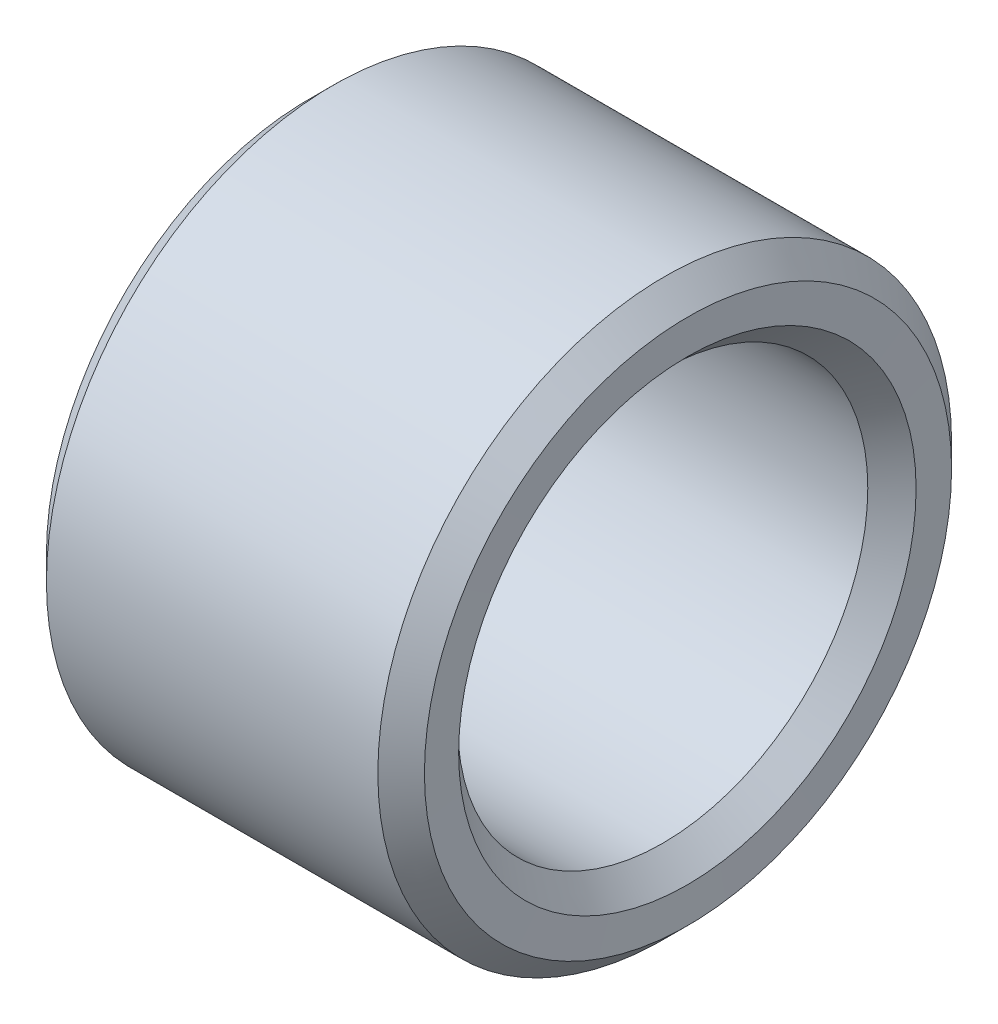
from build123d import *
from OCP.BRepFilletAPI import BRepFilletAPI_MakeChamfer

# Parameters (mm, degrees)
CHANFREIN1_SIZE    = 0.5
CHANFREIN1_SIZE2   = 0.491125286
CHANFREIN1_SIZE2_2 = 0.509373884


with BuildPart() as part:
    # Esquisse1 → R_volution2 (revolve)
    with BuildSketch(Plane.XY, mode=Mode.PRIVATE) as r_volution2_sk:
        Polygon((-332.272441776, -77.817904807), (-332.272441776, -76.092334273), (-324.284792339, -76.092334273), (-324.316265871, -77.817904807), align=None)
    revolve(r_volution2_sk.sketch.rotate(Axis((-305, -82.14054868, 0), (-1, 0, 0)), 90), axis=Axis((-305, -82.14054868, 0), (-1, 0, 0)))

    # Chanfrein1: one chamfer whose edges measure the first distance from different faces: ONE call of the kernel's chamfer builder (chamfer() names one face for all edges)
    chanfrein1_edges_1 = [part.edges().sort_by_distance(p)[0] for p in [
        (-324.284792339, -82.14054868, 6.048214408),
    ]]
    chanfrein1_side_1 = [part.faces().sort_by_distance(p)[0] for p in [
        (-328.278617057, -82.14054868, 6.048214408),
    ]]
    chanfrein1_edges_2 = [part.edges().sort_by_distance(p)[0] for p in [
        (-324.316265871, -82.14054868, 4.322643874),
    ]]
    chanfrein1_side_2 = [part.faces().sort_by_distance(p)[0] for p in [
        (-324.300529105, -82.14054868, 5.185429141),
    ]]
    chanfrein1_edges_3 = [part.edges().sort_by_distance(p)[0] for p in [
        (-332.272441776, -82.14054868, 4.322643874),
        (-332.272441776, -82.14054868, 6.048214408),
    ]]
    chanfrein1 = BRepFilletAPI_MakeChamfer(part.part.solid().wrapped)
    for e in chanfrein1_edges_1:
        chanfrein1.Add(CHANFREIN1_SIZE, CHANFREIN1_SIZE2, e.wrapped, chanfrein1_side_1[0].wrapped)  # the first distance lies on this face
    for e in chanfrein1_edges_2:
        chanfrein1.Add(CHANFREIN1_SIZE, CHANFREIN1_SIZE2_2, e.wrapped, chanfrein1_side_2[0].wrapped)  # the first distance lies on this face
    for e in chanfrein1_edges_3:
        chanfrein1.Add(CHANFREIN1_SIZE, e.wrapped)
    add(Compound.cast(chanfrein1.Shape()), mode=Mode.REPLACE)


solid = part.part
